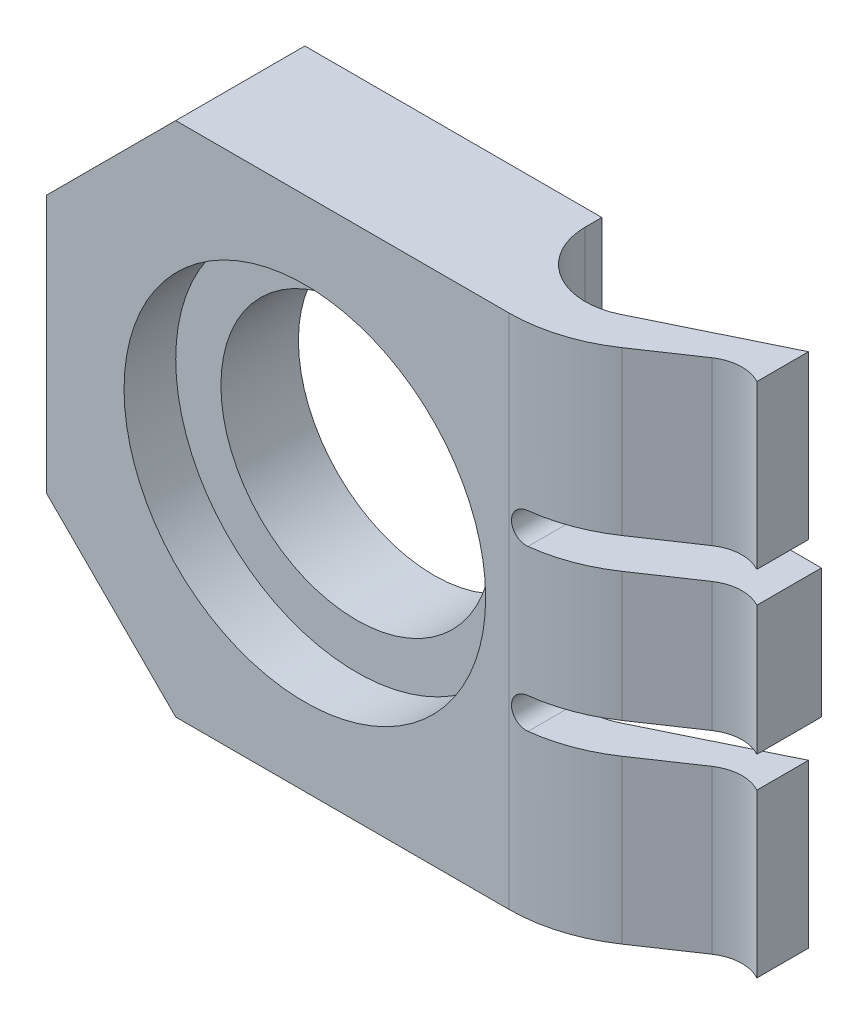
ISO-10303-21;
HEADER;
FILE_DESCRIPTION(('STEP AP214'),'2;1');
FILE_NAME('part.step','',(''),(''),'','','');
FILE_SCHEMA(('AUTOMOTIVE_DESIGN { 1 0 10303 214 1 1 1 1 }'));
ENDSEC;
DATA;
#1=APPLICATION_CONTEXT('core data for automotive mechanical design processes');
#2=APPLICATION_PROTOCOL_DEFINITION('international standard','automotive_design',2000,#1);
#3=PRODUCT_CONTEXT('',#1,'mechanical');
#4=PRODUCT('Part','Part','',(#3));
#5=PRODUCT_RELATED_PRODUCT_CATEGORY('part','',(#4));
#6=PRODUCT_DEFINITION_FORMATION('','',#4);
#7=PRODUCT_DEFINITION_CONTEXT('part definition',#1,'design');
#8=PRODUCT_DEFINITION('design','',#6,#7);
#9=PRODUCT_DEFINITION_SHAPE('','',#8);
#10=(LENGTH_UNIT() NAMED_UNIT(*) SI_UNIT(.MILLI.,.METRE.));
#11=(NAMED_UNIT(*) PLANE_ANGLE_UNIT() SI_UNIT($,.RADIAN.));
#12=(NAMED_UNIT(*) SI_UNIT($,.STERADIAN.) SOLID_ANGLE_UNIT());
#13=UNCERTAINTY_MEASURE_WITH_UNIT(LENGTH_MEASURE(1.E-05),#10,'distance_accuracy_value','');
#14=(GEOMETRIC_REPRESENTATION_CONTEXT(3) GLOBAL_UNCERTAINTY_ASSIGNED_CONTEXT((#13)) GLOBAL_UNIT_ASSIGNED_CONTEXT((#10,
#11,#12)) REPRESENTATION_CONTEXT('',''));
#15=CARTESIAN_POINT('',(0.,0.,0.));
#16=DIRECTION('',(0.,0.,1.));
#17=DIRECTION('',(1.,0.,0.));
#18=AXIS2_PLACEMENT_3D('',#15,#16,#17);
#19=CARTESIAN_POINT('',(14.2254033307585,-10.,3.9));
#20=DIRECTION('',(0.,1.,0.));
#21=DIRECTION('',(0.,0.,-1.));
#22=AXIS2_PLACEMENT_3D('',#19,#20,#21);
#23=CYLINDRICAL_SURFACE('',#22,1.6);
#24=CARTESIAN_POINT('',(14.2254033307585,-10.,3.9));
#25=DIRECTION('',(0.,1.,0.));
#26=DIRECTION('',(0.,0.,-1.));
#27=AXIS2_PLACEMENT_3D('',#24,#25,#26);
#28=CIRCLE('',#27,1.6);
#29=CARTESIAN_POINT('',(15.,-10.,2.5));
#30=VERTEX_POINT('',#29);
#31=CARTESIAN_POINT('',(13.3306946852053,-10.,2.57353988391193));
#32=VERTEX_POINT('',#31);
#33=EDGE_CURVE('E17',#30,#32,#28,.T.);
#34=ORIENTED_EDGE('',*,*,#33,.F.);
#35=DIRECTION('',(0.,-1.,0.));
#36=VECTOR('',#35,1.);
#37=CARTESIAN_POINT('',(15.,10.,2.5));
#38=LINE('',#37,#36);
#39=CARTESIAN_POINT('',(15.,-3.7,2.5));
#40=VERTEX_POINT('',#39);
#41=EDGE_CURVE('E322',#30,#40,#38,.F.);
#42=ORIENTED_EDGE('',*,*,#41,.T.);
#43=CARTESIAN_POINT('',(14.2254033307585,-3.7,3.9));
#44=DIRECTION('',(0.,1.,0.));
#45=DIRECTION('',(0.,0.,-1.));
#46=AXIS2_PLACEMENT_3D('',#43,#44,#45);
#47=CIRCLE('',#46,1.6);
#48=CARTESIAN_POINT('',(13.3306946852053,-3.7,2.57353988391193));
#49=VERTEX_POINT('',#48);
#50=EDGE_CURVE('E611',#40,#49,#47,.T.);
#51=ORIENTED_EDGE('',*,*,#50,.T.);
#52=DIRECTION('',(0.,-1.,0.));
#53=VECTOR('',#52,1.);
#54=CARTESIAN_POINT('',(13.3306946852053,-10.,2.57353988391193));
#55=LINE('',#54,#53);
#56=EDGE_CURVE('E325',#49,#32,#55,.T.);
#57=ORIENTED_EDGE('',*,*,#56,.T.);
#58=EDGE_LOOP('',(#34,#42,#51,#57));
#59=FACE_BOUND('',#58,.T.);
#60=ADVANCED_FACE('F14',(#59),#23,.F.);
#61=CARTESIAN_POINT('',(14.2254033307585,-10.,3.9));
#62=DIRECTION('',(0.,1.,0.));
#63=DIRECTION('',(0.,0.,-1.));
#64=AXIS2_PLACEMENT_3D('',#61,#62,#63);
#65=CYLINDRICAL_SURFACE('',#64,1.6);
#66=DIRECTION('',(0.,-1.,0.));
#67=VECTOR('',#66,1.);
#68=CARTESIAN_POINT('',(13.3306946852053,-10.,2.57353988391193));
#69=LINE('',#68,#67);
#70=CARTESIAN_POINT('',(13.3306946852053,10.,2.57353988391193));
#71=VERTEX_POINT('',#70);
#72=CARTESIAN_POINT('',(13.3306946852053,3.7,2.57353988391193));
#73=VERTEX_POINT('',#72);
#74=EDGE_CURVE('E271',#71,#73,#69,.T.);
#75=ORIENTED_EDGE('',*,*,#74,.T.);
#76=CARTESIAN_POINT('',(14.2254033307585,3.7,3.9));
#77=DIRECTION('',(0.,1.,0.));
#78=DIRECTION('',(0.,0.,-1.));
#79=AXIS2_PLACEMENT_3D('',#76,#77,#78);
#80=CIRCLE('',#79,1.6);
#81=CARTESIAN_POINT('',(15.,3.7,2.5));
#82=VERTEX_POINT('',#81);
#83=EDGE_CURVE('E471',#73,#82,#80,.F.);
#84=ORIENTED_EDGE('',*,*,#83,.T.);
#85=DIRECTION('',(0.,-1.,0.));
#86=VECTOR('',#85,1.);
#87=CARTESIAN_POINT('',(15.,10.,2.5));
#88=LINE('',#87,#86);
#89=CARTESIAN_POINT('',(15.,10.,2.5));
#90=VERTEX_POINT('',#89);
#91=EDGE_CURVE('E275',#82,#90,#88,.F.);
#92=ORIENTED_EDGE('',*,*,#91,.T.);
#93=CARTESIAN_POINT('',(14.2254033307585,10.,3.9));
#94=DIRECTION('',(0.,1.,0.));
#95=DIRECTION('',(0.,0.,-1.));
#96=AXIS2_PLACEMENT_3D('',#93,#94,#95);
#97=CIRCLE('',#96,1.6);
#98=EDGE_CURVE('E614',#71,#90,#97,.F.);
#99=ORIENTED_EDGE('',*,*,#98,.F.);
#100=EDGE_LOOP('',(#75,#84,#92,#99));
#101=FACE_BOUND('',#100,.T.);
#102=ADVANCED_FACE('F647',(#101),#65,.F.);
#103=CARTESIAN_POINT('',(15.,-3.7,0.));
#104=DIRECTION('',(0.,-1.,0.));
#105=DIRECTION('',(0.,0.,1.));
#106=AXIS2_PLACEMENT_3D('',#103,#104,#105);
#107=PLANE('',#106);
#108=CARTESIAN_POINT('',(9.,-3.7,0.644890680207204));
#109=DIRECTION('',(0.,-1.,0.));
#110=DIRECTION('',(0.,0.,1.));
#111=AXIS2_PLACEMENT_3D('',#108,#109,#110);
#112=CIRCLE('',#111,2.5);
#113=CARTESIAN_POINT('',(10.0959278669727,-3.7,2.89187579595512));
#114=VERTEX_POINT('',#113);
#115=CARTESIAN_POINT('',(8.6,-3.7,3.11268321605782));
#116=VERTEX_POINT('',#115);
#117=EDGE_CURVE('E382',#114,#116,#112,.T.);
#118=ORIENTED_EDGE('',*,*,#117,.T.);
#119=DIRECTION('',(0.,0.,-1.));
#120=VECTOR('',#119,1.);
#121=CARTESIAN_POINT('',(8.6,-3.7,0.));
#122=LINE('',#121,#120);
#123=CARTESIAN_POINT('',(8.6,-3.7,4.95890162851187));
#124=VERTEX_POINT('',#123);
#125=EDGE_CURVE('E203',#116,#124,#122,.F.);
#126=ORIENTED_EDGE('',*,*,#125,.T.);
#127=CARTESIAN_POINT('',(7.89893553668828,-3.7,-1.));
#128=DIRECTION('',(0.,1.,0.));
#129=DIRECTION('',(0.,0.,-1.));
#130=AXIS2_PLACEMENT_3D('',#127,#128,#129);
#131=CIRCLE('',#130,6.);
#132=CARTESIAN_POINT('',(11.2540929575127,-3.7,3.97422543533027));
#133=VERTEX_POINT('',#132);
#134=EDGE_CURVE('E332',#133,#124,#131,.F.);
#135=ORIENTED_EDGE('',*,*,#134,.F.);
#136=DIRECTION('',(0.829037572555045,0.,-0.559192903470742));
#137=VECTOR('',#136,1.);
#138=CARTESIAN_POINT('',(7.07979483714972,-3.7,6.78982506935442));
#139=LINE('',#138,#137);
#140=EDGE_CURVE('E328',#133,#49,#139,.T.);
#141=ORIENTED_EDGE('',*,*,#140,.T.);
#142=ORIENTED_EDGE('',*,*,#50,.F.);
#143=DIRECTION('',(0.,0.,-1.));
#144=VECTOR('',#143,1.);
#145=CARTESIAN_POINT('',(15.,-3.7,5.));
#146=LINE('',#145,#144);
#147=CARTESIAN_POINT('',(15.,-3.7,0.5));
#148=VERTEX_POINT('',#147);
#149=EDGE_CURVE('E319',#40,#148,#146,.T.);
#150=ORIENTED_EDGE('',*,*,#149,.T.);
#151=DIRECTION('',(-0.898794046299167,0.,0.438371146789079));
#152=VECTOR('',#151,1.);
#153=CARTESIAN_POINT('',(5.09911846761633,-3.7,5.32898257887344));
#154=LINE('',#153,#152);
#155=EDGE_CURVE('E315',#148,#114,#154,.T.);
#156=ORIENTED_EDGE('',*,*,#155,.T.);
#157=EDGE_LOOP('',(#118,#126,#135,#141,#142,#150,#156));
#158=FACE_BOUND('',#157,.T.);
#159=ADVANCED_FACE('F645',(#158),#107,.F.);
#160=CARTESIAN_POINT('',(15.,3.7,0.));
#161=DIRECTION('',(0.,1.,0.));
#162=DIRECTION('',(0.,0.,-1.));
#163=AXIS2_PLACEMENT_3D('',#160,#161,#162);
#164=PLANE('',#163);
#165=CARTESIAN_POINT('',(9.,3.7,0.644890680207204));
#166=DIRECTION('',(0.,1.,0.));
#167=DIRECTION('',(0.,0.,-1.));
#168=AXIS2_PLACEMENT_3D('',#165,#166,#167);
#169=CIRCLE('',#168,2.5);
#170=CARTESIAN_POINT('',(10.0959278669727,3.7,2.89187579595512));
#171=VERTEX_POINT('',#170);
#172=CARTESIAN_POINT('',(8.6,3.7,3.11268321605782));
#173=VERTEX_POINT('',#172);
#174=EDGE_CURVE('E374',#171,#173,#169,.F.);
#175=ORIENTED_EDGE('',*,*,#174,.F.);
#176=DIRECTION('',(0.898794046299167,0.,-0.438371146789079));
#177=VECTOR('',#176,1.);
#178=CARTESIAN_POINT('',(5.09911846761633,3.7,5.32898257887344));
#179=LINE('',#178,#177);
#180=CARTESIAN_POINT('',(15.,3.7,0.5));
#181=VERTEX_POINT('',#180);
#182=EDGE_CURVE('E282',#181,#171,#179,.F.);
#183=ORIENTED_EDGE('',*,*,#182,.F.);
#184=DIRECTION('',(0.,0.,-1.));
#185=VECTOR('',#184,1.);
#186=CARTESIAN_POINT('',(15.,3.7,5.));
#187=LINE('',#186,#185);
#188=EDGE_CURVE('E278',#181,#82,#187,.F.);
#189=ORIENTED_EDGE('',*,*,#188,.T.);
#190=ORIENTED_EDGE('',*,*,#83,.F.);
#191=DIRECTION('',(0.829037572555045,0.,-0.559192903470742));
#192=VECTOR('',#191,1.);
#193=CARTESIAN_POINT('',(7.07979483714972,3.7,6.78982506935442));
#194=LINE('',#193,#192);
#195=CARTESIAN_POINT('',(11.2540929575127,3.7,3.97422543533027));
#196=VERTEX_POINT('',#195);
#197=EDGE_CURVE('E274',#73,#196,#194,.F.);
#198=ORIENTED_EDGE('',*,*,#197,.T.);
#199=CARTESIAN_POINT('',(7.89893553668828,3.7,-1.));
#200=DIRECTION('',(0.,1.,0.));
#201=DIRECTION('',(0.,0.,-1.));
#202=AXIS2_PLACEMENT_3D('',#199,#200,#201);
#203=CIRCLE('',#202,6.);
#204=CARTESIAN_POINT('',(8.6,3.7,4.95890162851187));
#205=VERTEX_POINT('',#204);
#206=EDGE_CURVE('E270',#205,#196,#203,.T.);
#207=ORIENTED_EDGE('',*,*,#206,.F.);
#208=DIRECTION('',(0.,0.,-1.));
#209=VECTOR('',#208,1.);
#210=CARTESIAN_POINT('',(8.6,3.7,0.));
#211=LINE('',#210,#209);
#212=EDGE_CURVE('E195',#205,#173,#211,.T.);
#213=ORIENTED_EDGE('',*,*,#212,.T.);
#214=EDGE_LOOP('',(#175,#183,#189,#190,#198,#207,#213));
#215=FACE_BOUND('',#214,.T.);
#216=ADVANCED_FACE('F469',(#215),#164,.F.);
#217=CARTESIAN_POINT('',(0.,0.,3.));
#218=DIRECTION('',(0.,0.,1.));
#219=DIRECTION('',(-1.,0.,0.));
#220=AXIS2_PLACEMENT_3D('',#217,#218,#219);
#221=CYLINDRICAL_SURFACE('',#220,7.);
#222=CARTESIAN_POINT('',(0.,0.,5.));
#223=DIRECTION('',(0.,0.,1.));
#224=DIRECTION('',(-1.,0.,0.));
#225=AXIS2_PLACEMENT_3D('',#222,#223,#224);
#226=CIRCLE('',#225,7.);
#227=CARTESIAN_POINT('',(-7.,0.,5.));
#228=VERTEX_POINT('',#227);
#229=EDGE_CURVE('E256',#228,#228,#226,.T.);
#230=ORIENTED_EDGE('',*,*,#229,.T.);
#231=EDGE_LOOP('',(#230));
#232=FACE_BOUND('',#231,.T.);
#233=CARTESIAN_POINT('',(0.,0.,3.));
#234=DIRECTION('',(0.,0.,1.));
#235=DIRECTION('',(-1.,0.,0.));
#236=AXIS2_PLACEMENT_3D('',#233,#234,#235);
#237=CIRCLE('',#236,7.);
#238=CARTESIAN_POINT('',(-7.,0.,3.));
#239=VERTEX_POINT('',#238);
#240=EDGE_CURVE('E287',#239,#239,#237,.T.);
#241=ORIENTED_EDGE('',*,*,#240,.F.);
#242=EDGE_LOOP('',(#241));
#243=FACE_BOUND('',#242,.T.);
#244=ADVANCED_FACE('F654',(#232,#243),#221,.F.);
#245=CARTESIAN_POINT('',(8.6,3.1,0.));
#246=DIRECTION('',(0.,0.,-1.));
#247=DIRECTION('',(1.,0.,0.));
#248=AXIS2_PLACEMENT_3D('',#245,#246,#247);
#249=CYLINDRICAL_SURFACE('',#248,0.6);
#250=ORIENTED_EDGE('',*,*,#212,.F.);
#251=CARTESIAN_POINT('',(8.6,2.5,4.95890162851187));
#252=CARTESIAN_POINT('',(8.56642636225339,2.49997024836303,4.96286264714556));
#253=CARTESIAN_POINT('',(8.53282063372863,2.5028164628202,4.96651790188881));
#254=CARTESIAN_POINT('',(8.46651031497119,2.51408086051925,4.97318453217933));
#255=CARTESIAN_POINT('',(8.4338052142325,2.52249581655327,4.97619627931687));
#256=CARTESIAN_POINT('',(8.37019895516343,2.54472560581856,4.9815500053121));
#257=CARTESIAN_POINT('',(8.33929902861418,2.5585440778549,4.98389153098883));
#258=CARTESIAN_POINT('',(8.2802353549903,2.59118944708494,4.98794497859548));
#259=CARTESIAN_POINT('',(8.25207085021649,2.61001495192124,4.98965707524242));
#260=CARTESIAN_POINT('',(8.19939537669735,2.65206329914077,4.99253026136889));
#261=CARTESIAN_POINT('',(8.17487026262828,2.67526827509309,4.99369352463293));
#262=CARTESIAN_POINT('',(8.1300413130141,2.72547162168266,4.99558960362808));
#263=CARTESIAN_POINT('',(8.1097382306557,2.75247066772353,4.99632234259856));
#264=CARTESIAN_POINT('',(8.07393994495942,2.80949332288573,4.99747409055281));
#265=CARTESIAN_POINT('',(8.05844476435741,2.83951694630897,4.997893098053));
#266=CARTESIAN_POINT('',(8.03270414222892,2.90173557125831,4.99852253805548));
#267=CARTESIAN_POINT('',(8.0224583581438,2.93393043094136,4.99873298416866));
#268=CARTESIAN_POINT('',(8.00749493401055,2.99962876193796,4.99902254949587));
#269=CARTESIAN_POINT('',(8.00278512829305,3.03313401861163,4.99910148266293));
#270=CARTESIAN_POINT('',(7.99905363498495,3.10046077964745,4.99916494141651));
#271=CARTESIAN_POINT('',(8.00003211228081,3.13428229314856,4.99914946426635));
#272=CARTESIAN_POINT('',(8.00765156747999,3.20129717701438,4.99901617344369));
#273=CARTESIAN_POINT('',(8.01429517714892,3.23449024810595,4.99889831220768));
#274=CARTESIAN_POINT('',(8.03305953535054,3.29928938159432,4.99850798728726));
#275=CARTESIAN_POINT('',(8.0451802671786,3.33089544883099,4.99823552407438));
#276=CARTESIAN_POINT('',(8.07455138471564,3.39161799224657,4.99744727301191));
#277=CARTESIAN_POINT('',(8.091801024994,3.42073482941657,4.99693152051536));
#278=CARTESIAN_POINT('',(8.13093631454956,3.47565420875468,4.99554481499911));
#279=CARTESIAN_POINT('',(8.1528217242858,3.50145692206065,4.99467388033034));
#280=CARTESIAN_POINT('',(8.20057011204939,3.54898685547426,4.99246075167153));
#281=CARTESIAN_POINT('',(8.22642825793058,3.57071895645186,4.9911191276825));
#282=CARTESIAN_POINT('',(8.28140256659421,3.60953704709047,4.98786067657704));
#283=CARTESIAN_POINT('',(8.31051959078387,3.62662180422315,4.98594369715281));
#284=CARTESIAN_POINT('',(8.37114149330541,3.65565577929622,4.98146685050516));
#285=CARTESIAN_POINT('',(8.40264496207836,3.66760800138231,4.97890736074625));
#286=CARTESIAN_POINT('',(8.46711106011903,3.68605526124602,4.97312437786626));
#287=CARTESIAN_POINT('',(8.50007160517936,3.69255784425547,4.96990181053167));
#288=CARTESIAN_POINT('',(8.55546123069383,3.69876422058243,4.96401600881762));
#289=CARTESIAN_POINT('',(8.57774436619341,3.70001050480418,4.96152358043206));
#290=CARTESIAN_POINT('',(8.6,3.7,4.95890162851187));
#291=B_SPLINE_CURVE_WITH_KNOTS('',3,(#251,#252,#253,#254,#255,#256,#257,#258,#259,#260,#261,
#262,#263,#264,#265,#266,#267,#268,#269,#270,#271,#272,#273,#274,#275,#276,#277,#278,#279,#280,
#281,#282,#283,#284,#285,#286,#287,#288,#289,#290),.UNSPECIFIED.,.F.,.F.,(4,2,2,2,2,2,2,2,2,2,2,
2,2,2,2,2,2,2,2,4),(0.,0.101292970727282,0.202527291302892,0.303829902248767,0.405104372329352,
0.505974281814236,0.606862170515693,0.707750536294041,0.808632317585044,0.90965669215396,
1.01068399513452,1.11175825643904,1.21283220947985,1.31389147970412,1.41494552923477,
1.51587762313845,1.61683645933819,1.71773612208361,1.81849585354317,1.88572059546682),.UNSPECIFIED.);
#292=CARTESIAN_POINT('',(8.6,2.5,4.95890162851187));
#293=VERTEX_POINT('',#292);
#294=EDGE_CURVE('E367',#293,#205,#291,.T.);
#295=ORIENTED_EDGE('',*,*,#294,.F.);
#296=DIRECTION('',(0.,0.,1.));
#297=VECTOR('',#296,1.);
#298=CARTESIAN_POINT('',(8.6,2.5,0.));
#299=LINE('',#298,#297);
#300=CARTESIAN_POINT('',(8.6,2.5,3.11268321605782));
#301=VERTEX_POINT('',#300);
#302=EDGE_CURVE('E218',#293,#301,#299,.F.);
#303=ORIENTED_EDGE('',*,*,#302,.T.);
#304=CARTESIAN_POINT('',(8.6,2.5,3.11268321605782));
#305=CARTESIAN_POINT('',(8.56562582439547,2.49997558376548,3.10713826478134));
#306=CARTESIAN_POINT('',(8.53141213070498,2.50295129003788,3.10082990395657));
#307=CARTESIAN_POINT('',(8.4642794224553,2.5145690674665,3.08704952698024));
#308=CARTESIAN_POINT('',(8.43135768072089,2.52319843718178,3.07958014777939));
#309=CARTESIAN_POINT('',(8.3676427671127,2.54578460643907,3.06381842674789));
#310=CARTESIAN_POINT('',(8.33684813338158,2.55973770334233,3.05552665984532));
#311=CARTESIAN_POINT('',(8.27808611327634,2.59255142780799,3.03858533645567));
#312=CARTESIAN_POINT('',(8.25012021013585,2.61141461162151,3.02993559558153));
#313=CARTESIAN_POINT('',(8.1969293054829,2.65420508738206,3.01256556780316));
#314=CARTESIAN_POINT('',(8.17180876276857,2.67826469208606,3.00385065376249));
#315=CARTESIAN_POINT('',(8.12597611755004,2.73052871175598,2.98725644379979));
#316=CARTESIAN_POINT('',(8.10526410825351,2.75873321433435,2.97937716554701));
#317=CARTESIAN_POINT('',(8.06913508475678,2.81825542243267,2.9652062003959));
#318=CARTESIAN_POINT('',(8.05365945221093,2.84953323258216,2.95889716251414));
#319=CARTESIAN_POINT('',(8.02829668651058,2.91460219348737,2.94836270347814));
#320=CARTESIAN_POINT('',(8.01840583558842,2.94839165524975,2.94413589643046));
#321=CARTESIAN_POINT('',(8.00516733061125,3.01490973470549,2.9384373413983));
#322=CARTESIAN_POINT('',(8.00140027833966,3.04753989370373,2.93678932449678));
#323=CARTESIAN_POINT('',(7.99924846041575,3.11300693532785,2.93585081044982));
#324=CARTESIAN_POINT('',(8.00086202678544,3.14584375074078,2.93655958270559));
#325=CARTESIAN_POINT('',(8.0091663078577,3.20897955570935,2.94016116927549));
#326=CARTESIAN_POINT('',(8.0155869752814,3.23932143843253,2.94293777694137));
#327=CARTESIAN_POINT('',(8.03293279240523,3.2984555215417,2.95029065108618));
#328=CARTESIAN_POINT('',(8.04385853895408,3.32724751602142,2.95486715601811));
#329=CARTESIAN_POINT('',(8.07022890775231,3.38343317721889,2.96560896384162));
#330=CARTESIAN_POINT('',(8.08579823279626,3.41075981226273,2.9718174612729));
#331=CARTESIAN_POINT('',(8.12085178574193,3.46248294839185,2.98528602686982));
#332=CARTESIAN_POINT('',(8.14033717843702,3.48687857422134,2.99254640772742));
#333=CARTESIAN_POINT('',(8.18432792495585,3.53397109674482,3.00820679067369));
#334=CARTESIAN_POINT('',(8.20909968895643,3.55640458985,3.01665141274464));
#335=CARTESIAN_POINT('',(8.2620055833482,3.59685952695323,3.03364262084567));
#336=CARTESIAN_POINT('',(8.29014167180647,3.61487838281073,3.04218926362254));
#337=CARTESIAN_POINT('',(8.35039936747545,3.64672786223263,3.05923143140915));
#338=CARTESIAN_POINT('',(8.38264142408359,3.66034099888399,3.06770839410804));
#339=CARTESIAN_POINT('',(8.44919053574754,3.68178522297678,3.08369650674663));
#340=CARTESIAN_POINT('',(8.48349404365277,3.68962595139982,3.09120924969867));
#341=CARTESIAN_POINT('',(8.53181226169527,3.69626942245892,3.1006984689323));
#342=CARTESIAN_POINT('',(8.54539530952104,3.69766670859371,3.10324924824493));
#343=CARTESIAN_POINT('',(8.57264382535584,3.69953102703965,3.10813195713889));
#344=CARTESIAN_POINT('',(8.58630914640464,3.69999939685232,3.11046419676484));
#345=CARTESIAN_POINT('',(8.6,3.7,3.11268321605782));
#346=B_SPLINE_CURVE_WITH_KNOTS('',3,(#304,#305,#306,#307,#308,#309,#310,#311,#312,#313,#314,
#315,#316,#317,#318,#319,#320,#321,#322,#323,#324,#325,#326,#327,#328,#329,#330,#331,#332,#333,
#334,#335,#336,#337,#338,#339,#340,#341,#342,#343,#344,#345),.UNSPECIFIED.,.F.,.F.,(4,2,2,2,2,2,
2,2,2,2,2,2,2,2,2,2,2,2,2,2,4),(0.,0.104267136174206,0.208300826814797,0.312262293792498,
0.416277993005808,0.523344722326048,0.630413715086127,0.736241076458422,0.841997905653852,
0.940149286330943,1.03827024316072,1.13125762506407,1.22425733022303,1.32002224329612,
1.41581568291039,1.51877167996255,1.6217878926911,1.72930682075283,1.83664576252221,
1.87829211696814,1.91987846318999),.UNSPECIFIED.);
#347=EDGE_CURVE('E288',#301,#173,#346,.T.);
#348=ORIENTED_EDGE('',*,*,#347,.T.);
#349=EDGE_LOOP('',(#250,#295,#303,#348));
#350=FACE_BOUND('',#349,.T.);
#351=ADVANCED_FACE('F427',(#350),#249,.F.);
#352=CARTESIAN_POINT('',(14.2254033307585,-10.,3.9));
#353=DIRECTION('',(0.,1.,0.));
#354=DIRECTION('',(0.,0.,-1.));
#355=AXIS2_PLACEMENT_3D('',#352,#353,#354);
#356=CYLINDRICAL_SURFACE('',#355,1.6);
#357=CARTESIAN_POINT('',(14.2254033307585,-2.5,3.9));
#358=DIRECTION('',(0.,1.,0.));
#359=DIRECTION('',(0.,0.,-1.));
#360=AXIS2_PLACEMENT_3D('',#357,#358,#359);
#361=CIRCLE('',#360,1.6);
#362=CARTESIAN_POINT('',(15.,-2.5,2.5));
#363=VERTEX_POINT('',#362);
#364=CARTESIAN_POINT('',(13.3306946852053,-2.5,2.57353988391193));
#365=VERTEX_POINT('',#364);
#366=EDGE_CURVE('E183',#363,#365,#361,.T.);
#367=ORIENTED_EDGE('',*,*,#366,.F.);
#368=DIRECTION('',(0.,-1.,0.));
#369=VECTOR('',#368,1.);
#370=CARTESIAN_POINT('',(15.,10.,2.5));
#371=LINE('',#370,#369);
#372=CARTESIAN_POINT('',(15.,2.5,2.5));
#373=VERTEX_POINT('',#372);
#374=EDGE_CURVE('E213',#363,#373,#371,.F.);
#375=ORIENTED_EDGE('',*,*,#374,.T.);
#376=CARTESIAN_POINT('',(14.2254033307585,2.5,3.9));
#377=DIRECTION('',(0.,1.,0.));
#378=DIRECTION('',(0.,0.,-1.));
#379=AXIS2_PLACEMENT_3D('',#376,#377,#378);
#380=CIRCLE('',#379,1.6);
#381=CARTESIAN_POINT('',(13.3306946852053,2.5,2.57353988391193));
#382=VERTEX_POINT('',#381);
#383=EDGE_CURVE('E200',#373,#382,#380,.T.);
#384=ORIENTED_EDGE('',*,*,#383,.T.);
#385=DIRECTION('',(0.,-1.,0.));
#386=VECTOR('',#385,1.);
#387=CARTESIAN_POINT('',(13.3306946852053,-10.,2.57353988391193));
#388=LINE('',#387,#386);
#389=EDGE_CURVE('E194',#382,#365,#388,.T.);
#390=ORIENTED_EDGE('',*,*,#389,.T.);
#391=EDGE_LOOP('',(#367,#375,#384,#390));
#392=FACE_BOUND('',#391,.T.);
#393=ADVANCED_FACE('F199',(#392),#356,.F.);
#394=CARTESIAN_POINT('',(7.07979483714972,-10.,6.78982506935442));
#395=DIRECTION('',(-0.559192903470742,0.,-0.829037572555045));
#396=DIRECTION('',(0.829037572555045,0.,-0.559192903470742));
#397=AXIS2_PLACEMENT_3D('',#394,#395,#396);
#398=PLANE('',#397);
#399=DIRECTION('',(0.,1.,0.));
#400=VECTOR('',#399,1.);
#401=CARTESIAN_POINT('',(11.2540929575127,-10.,3.97422543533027));
#402=LINE('',#401,#400);
#403=CARTESIAN_POINT('',(11.2540929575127,-2.5,3.97422543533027));
#404=VERTEX_POINT('',#403);
#405=CARTESIAN_POINT('',(11.2540929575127,2.5,3.97422543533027));
#406=VERTEX_POINT('',#405);
#407=EDGE_CURVE('E207',#404,#406,#402,.T.);
#408=ORIENTED_EDGE('',*,*,#407,.F.);
#409=DIRECTION('',(0.829037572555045,0.,-0.559192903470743));
#410=VECTOR('',#409,1.);
#411=CARTESIAN_POINT('',(11.2540929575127,-2.5,3.97422543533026));
#412=LINE('',#411,#410);
#413=EDGE_CURVE('E188',#404,#365,#412,.T.);
#414=ORIENTED_EDGE('',*,*,#413,.T.);
#415=ORIENTED_EDGE('',*,*,#389,.F.);
#416=DIRECTION('',(-0.829037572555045,0.,0.559192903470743));
#417=VECTOR('',#416,1.);
#418=CARTESIAN_POINT('',(13.3306946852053,2.5,2.57353988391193));
#419=LINE('',#418,#417);
#420=EDGE_CURVE('E223',#382,#406,#419,.T.);
#421=ORIENTED_EDGE('',*,*,#420,.T.);
#422=EDGE_LOOP('',(#408,#414,#415,#421));
#423=FACE_BOUND('',#422,.T.);
#424=ADVANCED_FACE('F205',(#423),#398,.F.);
#425=CARTESIAN_POINT('',(8.6,-3.1,0.));
#426=DIRECTION('',(0.,0.,-1.));
#427=DIRECTION('',(1.,0.,0.));
#428=AXIS2_PLACEMENT_3D('',#425,#426,#427);
#429=CYLINDRICAL_SURFACE('',#428,0.6);
#430=DIRECTION('',(0.,0.,-1.));
#431=VECTOR('',#430,1.);
#432=CARTESIAN_POINT('',(8.6,-2.5,0.));
#433=LINE('',#432,#431);
#434=CARTESIAN_POINT('',(8.6,-2.5,3.11268321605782));
#435=VERTEX_POINT('',#434);
#436=CARTESIAN_POINT('',(8.6,-2.5,4.95890162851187));
#437=VERTEX_POINT('',#436);
#438=EDGE_CURVE('E352',#435,#437,#433,.F.);
#439=ORIENTED_EDGE('',*,*,#438,.T.);
#440=CARTESIAN_POINT('',(8.6,-3.7,4.95890162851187));
#441=CARTESIAN_POINT('',(8.56642636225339,-3.70002975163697,4.96286264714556));
#442=CARTESIAN_POINT('',(8.53282063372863,-3.6971835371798,4.96651790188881));
#443=CARTESIAN_POINT('',(8.46651031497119,-3.68591913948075,4.97318453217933));
#444=CARTESIAN_POINT('',(8.4338052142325,-3.67750418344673,4.97619627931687));
#445=CARTESIAN_POINT('',(8.37019895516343,-3.65527439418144,4.9815500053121));
#446=CARTESIAN_POINT('',(8.33929902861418,-3.6414559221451,4.98389153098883));
#447=CARTESIAN_POINT('',(8.2802353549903,-3.60881055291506,4.98794497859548));
#448=CARTESIAN_POINT('',(8.25207085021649,-3.58998504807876,4.98965707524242));
#449=CARTESIAN_POINT('',(8.19939537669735,-3.54793670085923,4.99253026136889));
#450=CARTESIAN_POINT('',(8.17487026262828,-3.52473172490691,4.99369352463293));
#451=CARTESIAN_POINT('',(8.1300413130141,-3.47452837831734,4.99558960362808));
#452=CARTESIAN_POINT('',(8.1097382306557,-3.44752933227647,4.99632234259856));
#453=CARTESIAN_POINT('',(8.07393994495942,-3.39050667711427,4.99747409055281));
#454=CARTESIAN_POINT('',(8.05844476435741,-3.36048305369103,4.997893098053));
#455=CARTESIAN_POINT('',(8.03270414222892,-3.29826442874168,4.99852253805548));
#456=CARTESIAN_POINT('',(8.02245835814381,-3.26606956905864,4.99873298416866));
#457=CARTESIAN_POINT('',(8.00749493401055,-3.20037123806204,4.99902254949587));
#458=CARTESIAN_POINT('',(8.00278512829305,-3.16686598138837,4.99910148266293));
#459=CARTESIAN_POINT('',(7.99905363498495,-3.09953922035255,4.99916494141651));
#460=CARTESIAN_POINT('',(8.00003211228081,-3.06571770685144,4.99914946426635));
#461=CARTESIAN_POINT('',(8.00765156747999,-2.99870282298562,4.99901617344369));
#462=CARTESIAN_POINT('',(8.01429517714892,-2.96550975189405,4.99889831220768));
#463=CARTESIAN_POINT('',(8.03305953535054,-2.90071061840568,4.99850798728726));
#464=CARTESIAN_POINT('',(8.0451802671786,-2.86910455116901,4.99823552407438));
#465=CARTESIAN_POINT('',(8.07455138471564,-2.80838200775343,4.99744727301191));
#466=CARTESIAN_POINT('',(8.091801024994,-2.77926517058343,4.99693152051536));
#467=CARTESIAN_POINT('',(8.13093631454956,-2.72434579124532,4.99554481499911));
#468=CARTESIAN_POINT('',(8.1528217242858,-2.69854307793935,4.99467388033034));
#469=CARTESIAN_POINT('',(8.20057011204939,-2.65101314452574,4.99246075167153));
#470=CARTESIAN_POINT('',(8.22642825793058,-2.62928104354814,4.9911191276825));
#471=CARTESIAN_POINT('',(8.28140256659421,-2.59046295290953,4.98786067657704));
#472=CARTESIAN_POINT('',(8.31051959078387,-2.57337819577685,4.98594369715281));
#473=CARTESIAN_POINT('',(8.37114149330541,-2.54434422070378,4.98146685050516));
#474=CARTESIAN_POINT('',(8.40264496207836,-2.53239199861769,4.97890736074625));
#475=CARTESIAN_POINT('',(8.46711106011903,-2.51394473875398,4.97312437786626));
#476=CARTESIAN_POINT('',(8.50007160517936,-2.50744215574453,4.96990181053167));
#477=CARTESIAN_POINT('',(8.55546123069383,-2.50123577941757,4.96401600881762));
#478=CARTESIAN_POINT('',(8.57774436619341,-2.49998949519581,4.96152358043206));
#479=CARTESIAN_POINT('',(8.6,-2.5,4.95890162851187));
#480=B_SPLINE_CURVE_WITH_KNOTS('',3,(#440,#441,#442,#443,#444,#445,#446,#447,#448,#449,#450,
#451,#452,#453,#454,#455,#456,#457,#458,#459,#460,#461,#462,#463,#464,#465,#466,#467,#468,#469,
#470,#471,#472,#473,#474,#475,#476,#477,#478,#479),.UNSPECIFIED.,.F.,.F.,(4,2,2,2,2,2,2,2,2,2,2,
2,2,2,2,2,2,2,2,4),(0.,0.101292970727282,0.202527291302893,0.303829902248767,0.405104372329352,
0.505974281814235,0.606862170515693,0.707750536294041,0.808632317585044,0.90965669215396,
1.01068399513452,1.11175825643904,1.21283220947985,1.31389147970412,1.41494552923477,
1.51587762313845,1.61683645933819,1.71773612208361,1.81849585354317,1.88572059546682),.UNSPECIFIED.);
#481=EDGE_CURVE('E368',#124,#437,#480,.T.);
#482=ORIENTED_EDGE('',*,*,#481,.F.);
#483=ORIENTED_EDGE('',*,*,#125,.F.);
#484=CARTESIAN_POINT('',(8.6,-3.7,3.11268321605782));
#485=CARTESIAN_POINT('',(8.56562582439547,-3.70002441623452,3.10713826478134));
#486=CARTESIAN_POINT('',(8.53141213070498,-3.69704870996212,3.10082990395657));
#487=CARTESIAN_POINT('',(8.4642794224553,-3.6854309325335,3.08704952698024));
#488=CARTESIAN_POINT('',(8.43135768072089,-3.67680156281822,3.07958014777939));
#489=CARTESIAN_POINT('',(8.3676427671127,-3.65421539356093,3.06381842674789));
#490=CARTESIAN_POINT('',(8.33684813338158,-3.64026229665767,3.05552665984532));
#491=CARTESIAN_POINT('',(8.27808611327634,-3.60744857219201,3.03858533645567));
#492=CARTESIAN_POINT('',(8.25012021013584,-3.58858538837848,3.02993559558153));
#493=CARTESIAN_POINT('',(8.1969293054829,-3.54579491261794,3.01256556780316));
#494=CARTESIAN_POINT('',(8.17180876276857,-3.52173530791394,3.00385065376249));
#495=CARTESIAN_POINT('',(8.12597611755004,-3.46947128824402,2.98725644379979));
#496=CARTESIAN_POINT('',(8.10526410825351,-3.44126678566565,2.97937716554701));
#497=CARTESIAN_POINT('',(8.06913508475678,-3.38174457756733,2.9652062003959));
#498=CARTESIAN_POINT('',(8.05365945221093,-3.35046676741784,2.95889716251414));
#499=CARTESIAN_POINT('',(8.02829668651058,-3.28539780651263,2.94836270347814));
#500=CARTESIAN_POINT('',(8.01840583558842,-3.25160834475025,2.94413589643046));
#501=CARTESIAN_POINT('',(8.00516733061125,-3.18509026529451,2.9384373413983));
#502=CARTESIAN_POINT('',(8.00140027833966,-3.15246010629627,2.93678932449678));
#503=CARTESIAN_POINT('',(7.99924846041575,-3.08699306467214,2.93585081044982));
#504=CARTESIAN_POINT('',(8.00086202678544,-3.05415624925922,2.93655958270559));
#505=CARTESIAN_POINT('',(8.0091663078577,-2.99102044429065,2.94016116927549));
#506=CARTESIAN_POINT('',(8.0155869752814,-2.96067856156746,2.94293777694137));
#507=CARTESIAN_POINT('',(8.03293279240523,-2.90154447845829,2.95029065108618));
#508=CARTESIAN_POINT('',(8.04385853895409,-2.87275248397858,2.95486715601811));
#509=CARTESIAN_POINT('',(8.07022890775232,-2.81656682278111,2.96560896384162));
#510=CARTESIAN_POINT('',(8.08579823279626,-2.78924018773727,2.9718174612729));
#511=CARTESIAN_POINT('',(8.12085178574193,-2.73751705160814,2.98528602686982));
#512=CARTESIAN_POINT('',(8.14033717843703,-2.71312142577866,2.99254640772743));
#513=CARTESIAN_POINT('',(8.18432792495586,-2.66602890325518,3.00820679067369));
#514=CARTESIAN_POINT('',(8.20909968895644,-2.64359541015,3.01665141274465));
#515=CARTESIAN_POINT('',(8.2620055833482,-2.60314047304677,3.03364262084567));
#516=CARTESIAN_POINT('',(8.29014167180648,-2.58512161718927,3.04218926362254));
#517=CARTESIAN_POINT('',(8.35039936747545,-2.55327213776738,3.05923143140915));
#518=CARTESIAN_POINT('',(8.38264142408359,-2.53965900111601,3.06770839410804));
#519=CARTESIAN_POINT('',(8.44919053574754,-2.51821477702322,3.08369650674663));
#520=CARTESIAN_POINT('',(8.48349404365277,-2.51037404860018,3.09120924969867));
#521=CARTESIAN_POINT('',(8.53181226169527,-2.50373057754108,3.1006984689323));
#522=CARTESIAN_POINT('',(8.54539530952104,-2.50233329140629,3.10324924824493));
#523=CARTESIAN_POINT('',(8.57264382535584,-2.50046897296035,3.10813195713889));
#524=CARTESIAN_POINT('',(8.58630914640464,-2.50000060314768,3.11046419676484));
#525=CARTESIAN_POINT('',(8.6,-2.5,3.11268321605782));
#526=B_SPLINE_CURVE_WITH_KNOTS('',3,(#484,#485,#486,#487,#488,#489,#490,#491,#492,#493,#494,
#495,#496,#497,#498,#499,#500,#501,#502,#503,#504,#505,#506,#507,#508,#509,#510,#511,#512,#513,
#514,#515,#516,#517,#518,#519,#520,#521,#522,#523,#524,#525),.UNSPECIFIED.,.F.,.F.,(4,2,2,2,2,2,
2,2,2,2,2,2,2,2,2,2,2,2,2,2,4),(0.,0.104267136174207,0.208300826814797,0.312262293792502,
0.416277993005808,0.523344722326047,0.630413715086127,0.736241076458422,0.841997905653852,
0.940149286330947,1.03827024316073,1.13125762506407,1.22425733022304,1.32002224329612,
1.4158156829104,1.51877167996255,1.62178789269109,1.72930682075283,1.83664576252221,
1.87829211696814,1.91987846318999),.UNSPECIFIED.);
#527=EDGE_CURVE('E360',#116,#435,#526,.T.);
#528=ORIENTED_EDGE('',*,*,#527,.T.);
#529=EDGE_LOOP('',(#439,#482,#483,#528));
#530=FACE_BOUND('',#529,.T.);
#531=ADVANCED_FACE('F509',(#530),#429,.F.);
#532=CARTESIAN_POINT('',(9.,-2.5,0.644890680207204));
#533=DIRECTION('',(0.,-1.,0.));
#534=DIRECTION('',(0.,0.,1.));
#535=AXIS2_PLACEMENT_3D('',#532,#533,#534);
#536=CYLINDRICAL_SURFACE('',#535,2.5);
#537=ORIENTED_EDGE('',*,*,#117,.F.);
#538=DIRECTION('',(0.,-1.,0.));
#539=VECTOR('',#538,1.);
#540=CARTESIAN_POINT('',(10.0959278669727,-2.5,2.89187579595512));
#541=LINE('',#540,#539);
#542=CARTESIAN_POINT('',(10.0959278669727,-10.,2.89187579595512));
#543=VERTEX_POINT('',#542);
#544=EDGE_CURVE('E312',#114,#543,#541,.T.);
#545=ORIENTED_EDGE('',*,*,#544,.T.);
#546=CARTESIAN_POINT('',(9.,-10.,0.644890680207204));
#547=DIRECTION('',(0.,-1.,0.));
#548=DIRECTION('',(0.,0.,1.));
#549=AXIS2_PLACEMENT_3D('',#546,#547,#548);
#550=CIRCLE('',#549,2.5);
#551=CARTESIAN_POINT('',(6.5,-10.,0.644890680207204));
#552=VERTEX_POINT('',#551);
#553=EDGE_CURVE('E336',#543,#552,#550,.T.);
#554=ORIENTED_EDGE('',*,*,#553,.T.);
#555=DIRECTION('',(0.,-1.,0.));
#556=VECTOR('',#555,1.);
#557=CARTESIAN_POINT('',(6.5,-2.5,0.644890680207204));
#558=LINE('',#557,#556);
#559=CARTESIAN_POINT('',(6.5,-2.5,0.644890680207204));
#560=VERTEX_POINT('',#559);
#561=EDGE_CURVE('E333',#560,#552,#558,.T.);
#562=ORIENTED_EDGE('',*,*,#561,.F.);
#563=CARTESIAN_POINT('',(9.,-2.5,0.644890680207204));
#564=DIRECTION('',(0.,-1.,0.));
#565=DIRECTION('',(0.,0.,1.));
#566=AXIS2_PLACEMENT_3D('',#563,#564,#565);
#567=CIRCLE('',#566,2.5);
#568=EDGE_CURVE('E211',#560,#435,#567,.F.);
#569=ORIENTED_EDGE('',*,*,#568,.T.);
#570=ORIENTED_EDGE('',*,*,#527,.F.);
#571=EDGE_LOOP('',(#537,#545,#554,#562,#569,#570));
#572=FACE_BOUND('',#571,.T.);
#573=ADVANCED_FACE('F525',(#572),#536,.F.);
#574=CARTESIAN_POINT('',(7.07979483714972,-10.,6.78982506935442));
#575=DIRECTION('',(-0.559192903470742,0.,-0.829037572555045));
#576=DIRECTION('',(0.829037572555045,0.,-0.559192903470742));
#577=AXIS2_PLACEMENT_3D('',#574,#575,#576);
#578=PLANE('',#577);
#579=ORIENTED_EDGE('',*,*,#56,.F.);
#580=ORIENTED_EDGE('',*,*,#140,.F.);
#581=DIRECTION('',(0.,1.,0.));
#582=VECTOR('',#581,1.);
#583=CARTESIAN_POINT('',(11.2540929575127,-10.,3.97422543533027));
#584=LINE('',#583,#582);
#585=CARTESIAN_POINT('',(11.2540929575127,-10.,3.97422543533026));
#586=VERTEX_POINT('',#585);
#587=EDGE_CURVE('E329',#586,#133,#584,.T.);
#588=ORIENTED_EDGE('',*,*,#587,.F.);
#589=DIRECTION('',(0.829037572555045,0.,-0.559192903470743));
#590=VECTOR('',#589,1.);
#591=CARTESIAN_POINT('',(11.2540929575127,-10.,3.97422543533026));
#592=LINE('',#591,#590);
#593=EDGE_CURVE('E405',#586,#32,#592,.T.);
#594=ORIENTED_EDGE('',*,*,#593,.T.);
#595=EDGE_LOOP('',(#579,#580,#588,#594));
#596=FACE_BOUND('',#595,.T.);
#597=ADVANCED_FACE('F529',(#596),#578,.F.);
#598=CARTESIAN_POINT('',(15.,10.,5.));
#599=DIRECTION('',(-1.,0.,0.));
#600=DIRECTION('',(0.,0.,-1.));
#601=AXIS2_PLACEMENT_3D('',#598,#599,#600);
#602=PLANE('',#601);
#603=ORIENTED_EDGE('',*,*,#149,.F.);
#604=ORIENTED_EDGE('',*,*,#41,.F.);
#605=DIRECTION('',(0.,0.,-1.));
#606=VECTOR('',#605,1.);
#607=CARTESIAN_POINT('',(15.,-10.,5.));
#608=LINE('',#607,#606);
#609=CARTESIAN_POINT('',(15.,-10.,0.5));
#610=VERTEX_POINT('',#609);
#611=EDGE_CURVE('E490',#30,#610,#608,.T.);
#612=ORIENTED_EDGE('',*,*,#611,.T.);
#613=DIRECTION('',(0.,-1.,0.));
#614=VECTOR('',#613,1.);
#615=CARTESIAN_POINT('',(15.,-2.5,0.5));
#616=LINE('',#615,#614);
#617=EDGE_CURVE('E316',#610,#148,#616,.F.);
#618=ORIENTED_EDGE('',*,*,#617,.T.);
#619=EDGE_LOOP('',(#603,#604,#612,#618));
#620=FACE_BOUND('',#619,.T.);
#621=ADVANCED_FACE('F533',(#620),#602,.F.);
#622=CARTESIAN_POINT('',(5.09911846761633,-2.5,5.32898257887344));
#623=DIRECTION('',(0.438371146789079,0.,0.898794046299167));
#624=DIRECTION('',(-0.898794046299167,0.,0.438371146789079));
#625=AXIS2_PLACEMENT_3D('',#622,#623,#624);
#626=PLANE('',#625);
#627=ORIENTED_EDGE('',*,*,#544,.F.);
#628=ORIENTED_EDGE('',*,*,#155,.F.);
#629=ORIENTED_EDGE('',*,*,#617,.F.);
#630=DIRECTION('',(-0.898794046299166,0.,0.438371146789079));
#631=VECTOR('',#630,1.);
#632=CARTESIAN_POINT('',(15.,-10.,0.5));
#633=LINE('',#632,#631);
#634=EDGE_CURVE('E301',#610,#543,#633,.T.);
#635=ORIENTED_EDGE('',*,*,#634,.T.);
#636=EDGE_LOOP('',(#627,#628,#629,#635));
#637=FACE_BOUND('',#636,.T.);
#638=ADVANCED_FACE('F537',(#637),#626,.F.);
#639=CARTESIAN_POINT('',(5.09911846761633,2.5,5.32898257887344));
#640=DIRECTION('',(-0.438371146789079,0.,-0.898794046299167));
#641=DIRECTION('',(0.898794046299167,0.,-0.438371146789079));
#642=AXIS2_PLACEMENT_3D('',#639,#640,#641);
#643=PLANE('',#642);
#644=ORIENTED_EDGE('',*,*,#182,.T.);
#645=DIRECTION('',(0.,1.,0.));
#646=VECTOR('',#645,1.);
#647=CARTESIAN_POINT('',(10.0959278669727,2.5,2.89187579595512));
#648=LINE('',#647,#646);
#649=CARTESIAN_POINT('',(10.0959278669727,10.,2.89187579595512));
#650=VERTEX_POINT('',#649);
#651=EDGE_CURVE('E285',#171,#650,#648,.T.);
#652=ORIENTED_EDGE('',*,*,#651,.T.);
#653=DIRECTION('',(0.898794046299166,0.,-0.438371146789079));
#654=VECTOR('',#653,1.);
#655=CARTESIAN_POINT('',(10.0959278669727,10.,2.89187579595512));
#656=LINE('',#655,#654);
#657=CARTESIAN_POINT('',(15.,10.,0.5));
#658=VERTEX_POINT('',#657);
#659=EDGE_CURVE('E401',#650,#658,#656,.T.);
#660=ORIENTED_EDGE('',*,*,#659,.T.);
#661=DIRECTION('',(0.,-1.,0.));
#662=VECTOR('',#661,1.);
#663=CARTESIAN_POINT('',(15.,10.,0.5));
#664=LINE('',#663,#662);
#665=EDGE_CURVE('E279',#658,#181,#664,.T.);
#666=ORIENTED_EDGE('',*,*,#665,.T.);
#667=EDGE_LOOP('',(#644,#652,#660,#666));
#668=FACE_BOUND('',#667,.T.);
#669=ADVANCED_FACE('F541',(#668),#643,.T.);
#670=CARTESIAN_POINT('',(15.,10.,5.));
#671=DIRECTION('',(-1.,0.,0.));
#672=DIRECTION('',(0.,0.,-1.));
#673=AXIS2_PLACEMENT_3D('',#670,#671,#672);
#674=PLANE('',#673);
#675=ORIENTED_EDGE('',*,*,#91,.F.);
#676=ORIENTED_EDGE('',*,*,#188,.F.);
#677=ORIENTED_EDGE('',*,*,#665,.F.);
#678=DIRECTION('',(0.,0.,1.));
#679=VECTOR('',#678,1.);
#680=CARTESIAN_POINT('',(15.,10.,5.));
#681=LINE('',#680,#679);
#682=EDGE_CURVE('E475',#658,#90,#681,.T.);
#683=ORIENTED_EDGE('',*,*,#682,.T.);
#684=EDGE_LOOP('',(#675,#676,#677,#683));
#685=FACE_BOUND('',#684,.T.);
#686=ADVANCED_FACE('F544',(#685),#674,.F.);
#687=CARTESIAN_POINT('',(7.07979483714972,-10.,6.78982506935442));
#688=DIRECTION('',(-0.559192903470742,0.,-0.829037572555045));
#689=DIRECTION('',(0.829037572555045,0.,-0.559192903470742));
#690=AXIS2_PLACEMENT_3D('',#687,#688,#689);
#691=PLANE('',#690);
#692=DIRECTION('',(0.,1.,0.));
#693=VECTOR('',#692,1.);
#694=CARTESIAN_POINT('',(11.2540929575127,-10.,3.97422543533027));
#695=LINE('',#694,#693);
#696=CARTESIAN_POINT('',(11.2540929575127,10.,3.97422543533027));
#697=VERTEX_POINT('',#696);
#698=EDGE_CURVE('E257',#196,#697,#695,.T.);
#699=ORIENTED_EDGE('',*,*,#698,.F.);
#700=ORIENTED_EDGE('',*,*,#197,.F.);
#701=ORIENTED_EDGE('',*,*,#74,.F.);
#702=DIRECTION('',(-0.829037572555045,0.,0.559192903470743));
#703=VECTOR('',#702,1.);
#704=CARTESIAN_POINT('',(13.3306946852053,10.,2.57353988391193));
#705=LINE('',#704,#703);
#706=EDGE_CURVE('E398',#71,#697,#705,.T.);
#707=ORIENTED_EDGE('',*,*,#706,.T.);
#708=EDGE_LOOP('',(#699,#700,#701,#707));
#709=FACE_BOUND('',#708,.T.);
#710=ADVANCED_FACE('F447',(#709),#691,.F.);
#711=CARTESIAN_POINT('',(7.89893553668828,-10.,-1.));
#712=DIRECTION('',(0.,1.,0.));
#713=DIRECTION('',(0.,0.,-1.));
#714=AXIS2_PLACEMENT_3D('',#711,#712,#713);
#715=CYLINDRICAL_SURFACE('',#714,6.);
#716=CARTESIAN_POINT('',(7.89893553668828,10.,-1.));
#717=DIRECTION('',(0.,1.,0.));
#718=DIRECTION('',(0.,0.,-1.));
#719=AXIS2_PLACEMENT_3D('',#716,#717,#718);
#720=CIRCLE('',#719,6.);
#721=CARTESIAN_POINT('',(7.89893553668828,10.,5.));
#722=VERTEX_POINT('',#721);
#723=EDGE_CURVE('E396',#697,#722,#720,.F.);
#724=ORIENTED_EDGE('',*,*,#723,.T.);
#725=DIRECTION('',(0.,-1.,0.));
#726=VECTOR('',#725,1.);
#727=CARTESIAN_POINT('',(7.89893553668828,0.,5.));
#728=LINE('',#727,#726);
#729=CARTESIAN_POINT('',(7.89893553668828,-10.,5.));
#730=VERTEX_POINT('',#729);
#731=EDGE_CURVE('E254',#722,#730,#728,.T.);
#732=ORIENTED_EDGE('',*,*,#731,.T.);
#733=CARTESIAN_POINT('',(7.89893553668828,-10.,-1.));
#734=DIRECTION('',(0.,1.,0.));
#735=DIRECTION('',(0.,0.,-1.));
#736=AXIS2_PLACEMENT_3D('',#733,#734,#735);
#737=CIRCLE('',#736,6.);
#738=EDGE_CURVE('E402',#730,#586,#737,.T.);
#739=ORIENTED_EDGE('',*,*,#738,.T.);
#740=ORIENTED_EDGE('',*,*,#587,.T.);
#741=ORIENTED_EDGE('',*,*,#134,.T.);
#742=ORIENTED_EDGE('',*,*,#481,.T.);
#743=CARTESIAN_POINT('',(7.89893553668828,-2.5,-1.));
#744=DIRECTION('',(0.,1.,0.));
#745=DIRECTION('',(0.,0.,-1.));
#746=AXIS2_PLACEMENT_3D('',#743,#744,#745);
#747=CIRCLE('',#746,6.);
#748=EDGE_CURVE('E209',#437,#404,#747,.T.);
#749=ORIENTED_EDGE('',*,*,#748,.T.);
#750=ORIENTED_EDGE('',*,*,#407,.T.);
#751=CARTESIAN_POINT('',(7.89893553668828,2.5,-1.));
#752=DIRECTION('',(0.,1.,0.));
#753=DIRECTION('',(0.,0.,-1.));
#754=AXIS2_PLACEMENT_3D('',#751,#752,#753);
#755=CIRCLE('',#754,6.);
#756=EDGE_CURVE('E222',#406,#293,#755,.F.);
#757=ORIENTED_EDGE('',*,*,#756,.T.);
#758=ORIENTED_EDGE('',*,*,#294,.T.);
#759=ORIENTED_EDGE('',*,*,#206,.T.);
#760=ORIENTED_EDGE('',*,*,#698,.T.);
#761=EDGE_LOOP('',(#724,#732,#739,#740,#741,#742,#749,#750,#757,#758,#759,#760));
#762=FACE_BOUND('',#761,.T.);
#763=ADVANCED_FACE('F442',(#762),#715,.T.);
#764=CARTESIAN_POINT('',(2.5,0.,5.));
#765=DIRECTION('',(0.,0.,-1.));
#766=DIRECTION('',(1.,0.,0.));
#767=AXIS2_PLACEMENT_3D('',#764,#765,#766);
#768=PLANE('',#767);
#769=ORIENTED_EDGE('',*,*,#229,.F.);
#770=EDGE_LOOP('',(#769));
#771=FACE_BOUND('',#770,.T.);
#772=DIRECTION('',(-1.,0.,0.));
#773=VECTOR('',#772,1.);
#774=CARTESIAN_POINT('',(15.,10.,5.));
#775=LINE('',#774,#773);
#776=CARTESIAN_POINT('',(-5.,10.,5.));
#777=VERTEX_POINT('',#776);
#778=EDGE_CURVE('E265',#722,#777,#775,.T.);
#779=ORIENTED_EDGE('',*,*,#778,.T.);
#780=DIRECTION('',(0.707106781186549,0.707106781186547,0.));
#781=VECTOR('',#780,1.);
#782=CARTESIAN_POINT('',(-5.,10.,5.));
#783=LINE('',#782,#781);
#784=CARTESIAN_POINT('',(-10.,5.,5.));
#785=VERTEX_POINT('',#784);
#786=EDGE_CURVE('E258',#777,#785,#783,.F.);
#787=ORIENTED_EDGE('',*,*,#786,.T.);
#788=DIRECTION('',(0.,-1.,0.));
#789=VECTOR('',#788,1.);
#790=CARTESIAN_POINT('',(-10.,5.,5.));
#791=LINE('',#790,#789);
#792=CARTESIAN_POINT('',(-10.,-5.,5.));
#793=VERTEX_POINT('',#792);
#794=EDGE_CURVE('E289',#785,#793,#791,.T.);
#795=ORIENTED_EDGE('',*,*,#794,.T.);
#796=DIRECTION('',(-0.707106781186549,0.707106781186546,0.));
#797=VECTOR('',#796,1.);
#798=CARTESIAN_POINT('',(-5.,-10.,5.));
#799=LINE('',#798,#797);
#800=CARTESIAN_POINT('',(-5.,-10.,5.));
#801=VERTEX_POINT('',#800);
#802=EDGE_CURVE('E299',#793,#801,#799,.F.);
#803=ORIENTED_EDGE('',*,*,#802,.T.);
#804=DIRECTION('',(-1.,0.,0.));
#805=VECTOR('',#804,1.);
#806=CARTESIAN_POINT('',(15.,-10.,5.));
#807=LINE('',#806,#805);
#808=EDGE_CURVE('E406',#801,#730,#807,.F.);
#809=ORIENTED_EDGE('',*,*,#808,.T.);
#810=ORIENTED_EDGE('',*,*,#731,.F.);
#811=EDGE_LOOP('',(#779,#787,#795,#803,#809,#810));
#812=FACE_BOUND('',#811,.T.);
#813=ADVANCED_FACE('F437',(#771,#812),#768,.F.);
#814=CARTESIAN_POINT('',(9.,2.5,0.644890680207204));
#815=DIRECTION('',(0.,1.,0.));
#816=DIRECTION('',(0.,0.,-1.));
#817=AXIS2_PLACEMENT_3D('',#814,#815,#816);
#818=CYLINDRICAL_SURFACE('',#817,2.5);
#819=CARTESIAN_POINT('',(9.,10.,0.644890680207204));
#820=DIRECTION('',(0.,1.,0.));
#821=DIRECTION('',(0.,0.,-1.));
#822=AXIS2_PLACEMENT_3D('',#819,#820,#821);
#823=CIRCLE('',#822,2.5);
#824=CARTESIAN_POINT('',(6.5,10.,0.644890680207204));
#825=VERTEX_POINT('',#824);
#826=EDGE_CURVE('E296',#825,#650,#823,.T.);
#827=ORIENTED_EDGE('',*,*,#826,.T.);
#828=ORIENTED_EDGE('',*,*,#651,.F.);
#829=ORIENTED_EDGE('',*,*,#174,.T.);
#830=ORIENTED_EDGE('',*,*,#347,.F.);
#831=CARTESIAN_POINT('',(9.,2.5,0.644890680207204));
#832=DIRECTION('',(0.,1.,0.));
#833=DIRECTION('',(0.,0.,-1.));
#834=AXIS2_PLACEMENT_3D('',#831,#832,#833);
#835=CIRCLE('',#834,2.5);
#836=CARTESIAN_POINT('',(6.5,2.5,0.644890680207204));
#837=VERTEX_POINT('',#836);
#838=EDGE_CURVE('E414',#301,#837,#835,.F.);
#839=ORIENTED_EDGE('',*,*,#838,.T.);
#840=DIRECTION('',(0.,-1.,0.));
#841=VECTOR('',#840,1.);
#842=CARTESIAN_POINT('',(6.5,2.5,0.644890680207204));
#843=LINE('',#842,#841);
#844=EDGE_CURVE('E228',#837,#825,#843,.F.);
#845=ORIENTED_EDGE('',*,*,#844,.T.);
#846=EDGE_LOOP('',(#827,#828,#829,#830,#839,#845));
#847=FACE_BOUND('',#846,.T.);
#848=ADVANCED_FACE('F431',(#847),#818,.F.);
#849=CARTESIAN_POINT('',(0.,0.,3.));
#850=DIRECTION('',(0.,0.,1.));
#851=DIRECTION('',(-1.,0.,0.));
#852=AXIS2_PLACEMENT_3D('',#849,#850,#851);
#853=PLANE('',#852);
#854=CARTESIAN_POINT('',(0.,0.,3.));
#855=DIRECTION('',(0.,0.,-1.));
#856=DIRECTION('',(1.,0.,0.));
#857=AXIS2_PLACEMENT_3D('',#854,#855,#856);
#858=CIRCLE('',#857,5.25);
#859=CARTESIAN_POINT('',(5.25,0.,3.));
#860=VERTEX_POINT('',#859);
#861=EDGE_CURVE('E233',#860,#860,#858,.T.);
#862=ORIENTED_EDGE('',*,*,#861,.T.);
#863=EDGE_LOOP('',(#862));
#864=FACE_BOUND('',#863,.T.);
#865=ORIENTED_EDGE('',*,*,#240,.T.);
#866=EDGE_LOOP('',(#865));
#867=FACE_BOUND('',#866,.T.);
#868=ADVANCED_FACE('F436',(#864,#867),#853,.T.);
#869=CARTESIAN_POINT('',(15.,2.5,0.));
#870=DIRECTION('',(0.,-1.,0.));
#871=DIRECTION('',(0.,0.,1.));
#872=AXIS2_PLACEMENT_3D('',#869,#870,#871);
#873=PLANE('',#872);
#874=ORIENTED_EDGE('',*,*,#756,.F.);
#875=ORIENTED_EDGE('',*,*,#420,.F.);
#876=ORIENTED_EDGE('',*,*,#383,.F.);
#877=DIRECTION('',(0.,0.,-1.));
#878=VECTOR('',#877,1.);
#879=CARTESIAN_POINT('',(15.,2.5,5.));
#880=LINE('',#879,#878);
#881=CARTESIAN_POINT('',(15.,2.5,0.));
#882=VERTEX_POINT('',#881);
#883=EDGE_CURVE('E221',#373,#882,#880,.T.);
#884=ORIENTED_EDGE('',*,*,#883,.T.);
#885=DIRECTION('',(1.,0.,0.));
#886=VECTOR('',#885,1.);
#887=CARTESIAN_POINT('',(2.5,2.5,0.));
#888=LINE('',#887,#886);
#889=CARTESIAN_POINT('',(6.5,2.5,0.));
#890=VERTEX_POINT('',#889);
#891=EDGE_CURVE('E234',#890,#882,#888,.T.);
#892=ORIENTED_EDGE('',*,*,#891,.F.);
#893=DIRECTION('',(0.,0.,-1.));
#894=VECTOR('',#893,1.);
#895=CARTESIAN_POINT('',(6.5,2.5,0.));
#896=LINE('',#895,#894);
#897=EDGE_CURVE('E225',#890,#837,#896,.F.);
#898=ORIENTED_EDGE('',*,*,#897,.T.);
#899=ORIENTED_EDGE('',*,*,#838,.F.);
#900=ORIENTED_EDGE('',*,*,#302,.F.);
#901=EDGE_LOOP('',(#874,#875,#876,#884,#892,#898,#899,#900));
#902=FACE_BOUND('',#901,.T.);
#903=ADVANCED_FACE('F598',(#902),#873,.F.);
#904=CARTESIAN_POINT('',(15.,10.,5.));
#905=DIRECTION('',(-1.,0.,0.));
#906=DIRECTION('',(0.,0.,-1.));
#907=AXIS2_PLACEMENT_3D('',#904,#905,#906);
#908=PLANE('',#907);
#909=DIRECTION('',(0.,0.,-1.));
#910=VECTOR('',#909,1.);
#911=CARTESIAN_POINT('',(15.,-2.5,0.));
#912=LINE('',#911,#910);
#913=CARTESIAN_POINT('',(15.,-2.5,0.));
#914=VERTEX_POINT('',#913);
#915=EDGE_CURVE('E190',#363,#914,#912,.T.);
#916=ORIENTED_EDGE('',*,*,#915,.T.);
#917=DIRECTION('',(0.,-1.,0.));
#918=VECTOR('',#917,1.);
#919=CARTESIAN_POINT('',(15.,0.,0.));
#920=LINE('',#919,#918);
#921=EDGE_CURVE('E237',#882,#914,#920,.T.);
#922=ORIENTED_EDGE('',*,*,#921,.F.);
#923=ORIENTED_EDGE('',*,*,#883,.F.);
#924=ORIENTED_EDGE('',*,*,#374,.F.);
#925=EDGE_LOOP('',(#916,#922,#923,#924));
#926=FACE_BOUND('',#925,.T.);
#927=ADVANCED_FACE('F596',(#926),#908,.F.);
#928=CARTESIAN_POINT('',(15.,-2.5,0.));
#929=DIRECTION('',(0.,1.,0.));
#930=DIRECTION('',(0.,0.,-1.));
#931=AXIS2_PLACEMENT_3D('',#928,#929,#930);
#932=PLANE('',#931);
#933=ORIENTED_EDGE('',*,*,#568,.F.);
#934=DIRECTION('',(0.,0.,1.));
#935=VECTOR('',#934,1.);
#936=CARTESIAN_POINT('',(6.5,-2.5,0.));
#937=LINE('',#936,#935);
#938=CARTESIAN_POINT('',(6.5,-2.5,0.));
#939=VERTEX_POINT('',#938);
#940=EDGE_CURVE('E337',#939,#560,#937,.T.);
#941=ORIENTED_EDGE('',*,*,#940,.F.);
#942=DIRECTION('',(1.,0.,0.));
#943=VECTOR('',#942,1.);
#944=CARTESIAN_POINT('',(2.5,-2.5,0.));
#945=LINE('',#944,#943);
#946=EDGE_CURVE('E347',#914,#939,#945,.F.);
#947=ORIENTED_EDGE('',*,*,#946,.F.);
#948=ORIENTED_EDGE('',*,*,#915,.F.);
#949=ORIENTED_EDGE('',*,*,#366,.T.);
#950=ORIENTED_EDGE('',*,*,#413,.F.);
#951=ORIENTED_EDGE('',*,*,#748,.F.);
#952=ORIENTED_EDGE('',*,*,#438,.F.);
#953=EDGE_LOOP('',(#933,#941,#947,#948,#949,#950,#951,#952));
#954=FACE_BOUND('',#953,.T.);
#955=ADVANCED_FACE('F185',(#954),#932,.F.);
#956=CARTESIAN_POINT('',(6.5,-2.5,0.));
#957=DIRECTION('',(1.,0.,0.));
#958=DIRECTION('',(0.,0.,1.));
#959=AXIS2_PLACEMENT_3D('',#956,#957,#958);
#960=PLANE('',#959);
#961=DIRECTION('',(0.,0.,-1.));
#962=VECTOR('',#961,1.);
#963=CARTESIAN_POINT('',(6.5,-10.,5.));
#964=LINE('',#963,#962);
#965=CARTESIAN_POINT('',(6.5,-10.,0.));
#966=VERTEX_POINT('',#965);
#967=EDGE_CURVE('E408',#552,#966,#964,.T.);
#968=ORIENTED_EDGE('',*,*,#967,.T.);
#969=DIRECTION('',(0.,-1.,0.));
#970=VECTOR('',#969,1.);
#971=CARTESIAN_POINT('',(6.5,0.,0.));
#972=LINE('',#971,#970);
#973=EDGE_CURVE('E342',#939,#966,#972,.T.);
#974=ORIENTED_EDGE('',*,*,#973,.F.);
#975=ORIENTED_EDGE('',*,*,#940,.T.);
#976=ORIENTED_EDGE('',*,*,#561,.T.);
#977=EDGE_LOOP('',(#968,#974,#975,#976));
#978=FACE_BOUND('',#977,.T.);
#979=ADVANCED_FACE('F589',(#978),#960,.T.);
#980=CARTESIAN_POINT('',(15.,-10.,5.));
#981=DIRECTION('',(0.,1.,0.));
#982=DIRECTION('',(0.,0.,-1.));
#983=AXIS2_PLACEMENT_3D('',#980,#981,#982);
#984=PLANE('',#983);
#985=ORIENTED_EDGE('',*,*,#611,.F.);
#986=ORIENTED_EDGE('',*,*,#33,.T.);
#987=ORIENTED_EDGE('',*,*,#593,.F.);
#988=ORIENTED_EDGE('',*,*,#738,.F.);
#989=ORIENTED_EDGE('',*,*,#808,.F.);
#990=DIRECTION('',(0.,0.,1.));
#991=VECTOR('',#990,1.);
#992=CARTESIAN_POINT('',(-5.,-10.,5.));
#993=LINE('',#992,#991);
#994=CARTESIAN_POINT('',(-5.,-10.,0.));
#995=VERTEX_POINT('',#994);
#996=EDGE_CURVE('E291',#801,#995,#993,.F.);
#997=ORIENTED_EDGE('',*,*,#996,.T.);
#998=DIRECTION('',(1.,0.,0.));
#999=VECTOR('',#998,1.);
#1000=CARTESIAN_POINT('',(2.5,-10.,0.));
#1001=LINE('',#1000,#999);
#1002=EDGE_CURVE('E338',#966,#995,#1001,.F.);
#1003=ORIENTED_EDGE('',*,*,#1002,.F.);
#1004=ORIENTED_EDGE('',*,*,#967,.F.);
#1005=ORIENTED_EDGE('',*,*,#553,.F.);
#1006=ORIENTED_EDGE('',*,*,#634,.F.);
#1007=EDGE_LOOP('',(#985,#986,#987,#988,#989,#997,#1003,#1004,#1005,#1006));
#1008=FACE_BOUND('',#1007,.T.);
#1009=ADVANCED_FACE('F585',(#1008),#984,.F.);
#1010=CARTESIAN_POINT('',(-5.,-10.,5.));
#1011=DIRECTION('',(0.707106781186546,0.707106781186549,0.));
#1012=DIRECTION('',(-0.707106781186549,0.707106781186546,0.));
#1013=AXIS2_PLACEMENT_3D('',#1010,#1011,#1012);
#1014=PLANE('',#1013);
#1015=ORIENTED_EDGE('',*,*,#802,.F.);
#1016=DIRECTION('',(0.,0.,1.));
#1017=VECTOR('',#1016,1.);
#1018=CARTESIAN_POINT('',(-10.,-5.,5.));
#1019=LINE('',#1018,#1017);
#1020=CARTESIAN_POINT('',(-10.,-5.,0.));
#1021=VERTEX_POINT('',#1020);
#1022=EDGE_CURVE('E261',#793,#1021,#1019,.F.);
#1023=ORIENTED_EDGE('',*,*,#1022,.T.);
#1024=DIRECTION('',(-0.707106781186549,0.707106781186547,0.));
#1025=VECTOR('',#1024,1.);
#1026=CARTESIAN_POINT('',(-5.,-10.,0.));
#1027=LINE('',#1026,#1025);
#1028=EDGE_CURVE('E341',#995,#1021,#1027,.T.);
#1029=ORIENTED_EDGE('',*,*,#1028,.F.);
#1030=ORIENTED_EDGE('',*,*,#996,.F.);
#1031=EDGE_LOOP('',(#1015,#1023,#1029,#1030));
#1032=FACE_BOUND('',#1031,.T.);
#1033=ADVANCED_FACE('F581',(#1032),#1014,.F.);
#1034=CARTESIAN_POINT('',(-10.,5.,5.));
#1035=DIRECTION('',(1.,0.,0.));
#1036=DIRECTION('',(0.,0.,1.));
#1037=AXIS2_PLACEMENT_3D('',#1034,#1035,#1036);
#1038=PLANE('',#1037);
#1039=ORIENTED_EDGE('',*,*,#794,.F.);
#1040=DIRECTION('',(0.,0.,1.));
#1041=VECTOR('',#1040,1.);
#1042=CARTESIAN_POINT('',(-10.,5.,5.));
#1043=LINE('',#1042,#1041);
#1044=CARTESIAN_POINT('',(-10.,5.,0.));
#1045=VERTEX_POINT('',#1044);
#1046=EDGE_CURVE('E260',#785,#1045,#1043,.F.);
#1047=ORIENTED_EDGE('',*,*,#1046,.T.);
#1048=DIRECTION('',(0.,-1.,0.));
#1049=VECTOR('',#1048,1.);
#1050=CARTESIAN_POINT('',(-10.,0.,0.));
#1051=LINE('',#1050,#1049);
#1052=EDGE_CURVE('E635',#1021,#1045,#1051,.F.);
#1053=ORIENTED_EDGE('',*,*,#1052,.F.);
#1054=ORIENTED_EDGE('',*,*,#1022,.F.);
#1055=EDGE_LOOP('',(#1039,#1047,#1053,#1054));
#1056=FACE_BOUND('',#1055,.T.);
#1057=ADVANCED_FACE('F577',(#1056),#1038,.F.);
#1058=CARTESIAN_POINT('',(-5.,10.,5.));
#1059=DIRECTION('',(0.707106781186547,-0.707106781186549,0.));
#1060=DIRECTION('',(0.707106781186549,0.707106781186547,0.));
#1061=AXIS2_PLACEMENT_3D('',#1058,#1059,#1060);
#1062=PLANE('',#1061);
#1063=ORIENTED_EDGE('',*,*,#786,.F.);
#1064=DIRECTION('',(0.,0.,1.));
#1065=VECTOR('',#1064,1.);
#1066=CARTESIAN_POINT('',(-5.,10.,5.));
#1067=LINE('',#1066,#1065);
#1068=CARTESIAN_POINT('',(-5.,10.,0.));
#1069=VERTEX_POINT('',#1068);
#1070=EDGE_CURVE('E246',#777,#1069,#1067,.F.);
#1071=ORIENTED_EDGE('',*,*,#1070,.T.);
#1072=DIRECTION('',(0.707106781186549,0.707106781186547,0.));
#1073=VECTOR('',#1072,1.);
#1074=CARTESIAN_POINT('',(-10.,5.,0.));
#1075=LINE('',#1074,#1073);
#1076=EDGE_CURVE('E251',#1045,#1069,#1075,.T.);
#1077=ORIENTED_EDGE('',*,*,#1076,.F.);
#1078=ORIENTED_EDGE('',*,*,#1046,.F.);
#1079=EDGE_LOOP('',(#1063,#1071,#1077,#1078));
#1080=FACE_BOUND('',#1079,.T.);
#1081=ADVANCED_FACE('F574',(#1080),#1062,.F.);
#1082=CARTESIAN_POINT('',(15.,10.,5.));
#1083=DIRECTION('',(0.,-1.,0.));
#1084=DIRECTION('',(0.,0.,1.));
#1085=AXIS2_PLACEMENT_3D('',#1082,#1083,#1084);
#1086=PLANE('',#1085);
#1087=DIRECTION('',(1.,0.,0.));
#1088=VECTOR('',#1087,1.);
#1089=CARTESIAN_POINT('',(2.5,10.,0.));
#1090=LINE('',#1089,#1088);
#1091=CARTESIAN_POINT('',(6.5,10.,0.));
#1092=VERTEX_POINT('',#1091);
#1093=EDGE_CURVE('E242',#1069,#1092,#1090,.T.);
#1094=ORIENTED_EDGE('',*,*,#1093,.F.);
#1095=ORIENTED_EDGE('',*,*,#1070,.F.);
#1096=ORIENTED_EDGE('',*,*,#778,.F.);
#1097=ORIENTED_EDGE('',*,*,#723,.F.);
#1098=ORIENTED_EDGE('',*,*,#706,.F.);
#1099=ORIENTED_EDGE('',*,*,#98,.T.);
#1100=ORIENTED_EDGE('',*,*,#682,.F.);
#1101=ORIENTED_EDGE('',*,*,#659,.F.);
#1102=ORIENTED_EDGE('',*,*,#826,.F.);
#1103=DIRECTION('',(0.,0.,-1.));
#1104=VECTOR('',#1103,1.);
#1105=CARTESIAN_POINT('',(6.5,10.,0.));
#1106=LINE('',#1105,#1104);
#1107=EDGE_CURVE('E32',#825,#1092,#1106,.T.);
#1108=ORIENTED_EDGE('',*,*,#1107,.T.);
#1109=EDGE_LOOP('',(#1094,#1095,#1096,#1097,#1098,#1099,#1100,#1101,#1102,#1108));
#1110=FACE_BOUND('',#1109,.T.);
#1111=ADVANCED_FACE('F570',(#1110),#1086,.F.);
#1112=CARTESIAN_POINT('',(6.5,2.5,0.));
#1113=DIRECTION('',(-1.,0.,0.));
#1114=DIRECTION('',(0.,0.,-1.));
#1115=AXIS2_PLACEMENT_3D('',#1112,#1113,#1114);
#1116=PLANE('',#1115);
#1117=ORIENTED_EDGE('',*,*,#897,.F.);
#1118=DIRECTION('',(0.,-1.,0.));
#1119=VECTOR('',#1118,1.);
#1120=CARTESIAN_POINT('',(6.5,0.,0.));
#1121=LINE('',#1120,#1119);
#1122=EDGE_CURVE('E23',#1092,#890,#1121,.T.);
#1123=ORIENTED_EDGE('',*,*,#1122,.F.);
#1124=ORIENTED_EDGE('',*,*,#1107,.F.);
#1125=ORIENTED_EDGE('',*,*,#844,.F.);
#1126=EDGE_LOOP('',(#1117,#1123,#1124,#1125));
#1127=FACE_BOUND('',#1126,.T.);
#1128=ADVANCED_FACE('F563',(#1127),#1116,.F.);
#1129=CARTESIAN_POINT('',(0.,0.,5.));
#1130=DIRECTION('',(0.,0.,-1.));
#1131=DIRECTION('',(1.,0.,0.));
#1132=AXIS2_PLACEMENT_3D('',#1129,#1130,#1131);
#1133=CYLINDRICAL_SURFACE('',#1132,5.25);
#1134=ORIENTED_EDGE('',*,*,#861,.F.);
#1135=EDGE_LOOP('',(#1134));
#1136=FACE_BOUND('',#1135,.T.);
#1137=CARTESIAN_POINT('',(0.,0.,0.));
#1138=DIRECTION('',(0.,0.,-1.));
#1139=DIRECTION('',(1.,0.,0.));
#1140=AXIS2_PLACEMENT_3D('',#1137,#1138,#1139);
#1141=CIRCLE('',#1140,5.25);
#1142=CARTESIAN_POINT('',(5.25,0.,0.));
#1143=VERTEX_POINT('',#1142);
#1144=EDGE_CURVE('E9',#1143,#1143,#1141,.F.);
#1145=ORIENTED_EDGE('',*,*,#1144,.F.);
#1146=EDGE_LOOP('',(#1145));
#1147=FACE_BOUND('',#1146,.T.);
#1148=ADVANCED_FACE('F556',(#1136,#1147),#1133,.F.);
#1149=CARTESIAN_POINT('',(2.5,0.,0.));
#1150=DIRECTION('',(0.,0.,-1.));
#1151=DIRECTION('',(1.,0.,0.));
#1152=AXIS2_PLACEMENT_3D('',#1149,#1150,#1151);
#1153=PLANE('',#1152);
#1154=ORIENTED_EDGE('',*,*,#1144,.T.);
#1155=EDGE_LOOP('',(#1154));
#1156=FACE_BOUND('',#1155,.T.);
#1157=ORIENTED_EDGE('',*,*,#1093,.T.);
#1158=ORIENTED_EDGE('',*,*,#1122,.T.);
#1159=ORIENTED_EDGE('',*,*,#891,.T.);
#1160=ORIENTED_EDGE('',*,*,#921,.T.);
#1161=ORIENTED_EDGE('',*,*,#946,.T.);
#1162=ORIENTED_EDGE('',*,*,#973,.T.);
#1163=ORIENTED_EDGE('',*,*,#1002,.T.);
#1164=ORIENTED_EDGE('',*,*,#1028,.T.);
#1165=ORIENTED_EDGE('',*,*,#1052,.T.);
#1166=ORIENTED_EDGE('',*,*,#1076,.T.);
#1167=EDGE_LOOP('',(#1157,#1158,#1159,#1160,#1161,#1162,#1163,#1164,#1165,#1166));
#1168=FACE_BOUND('',#1167,.T.);
#1169=ADVANCED_FACE('F554',(#1156,#1168),#1153,.T.);
#1170=CLOSED_SHELL('',(#60,#102,#159,#216,#244,#351,#393,#424,#531,#573,#597,#621,#638,#669,
#686,#710,#763,#813,#848,#868,#903,#927,#955,#979,#1009,#1033,#1057,#1081,#1111,#1128,#1148,#1169));
#1171=MANIFOLD_SOLID_BREP('B1',#1170);
#1172=ADVANCED_BREP_SHAPE_REPRESENTATION('',(#18,#1171),#14);
#1173=SHAPE_DEFINITION_REPRESENTATION(#9,#1172);
ENDSEC;
END-ISO-10303-21;
